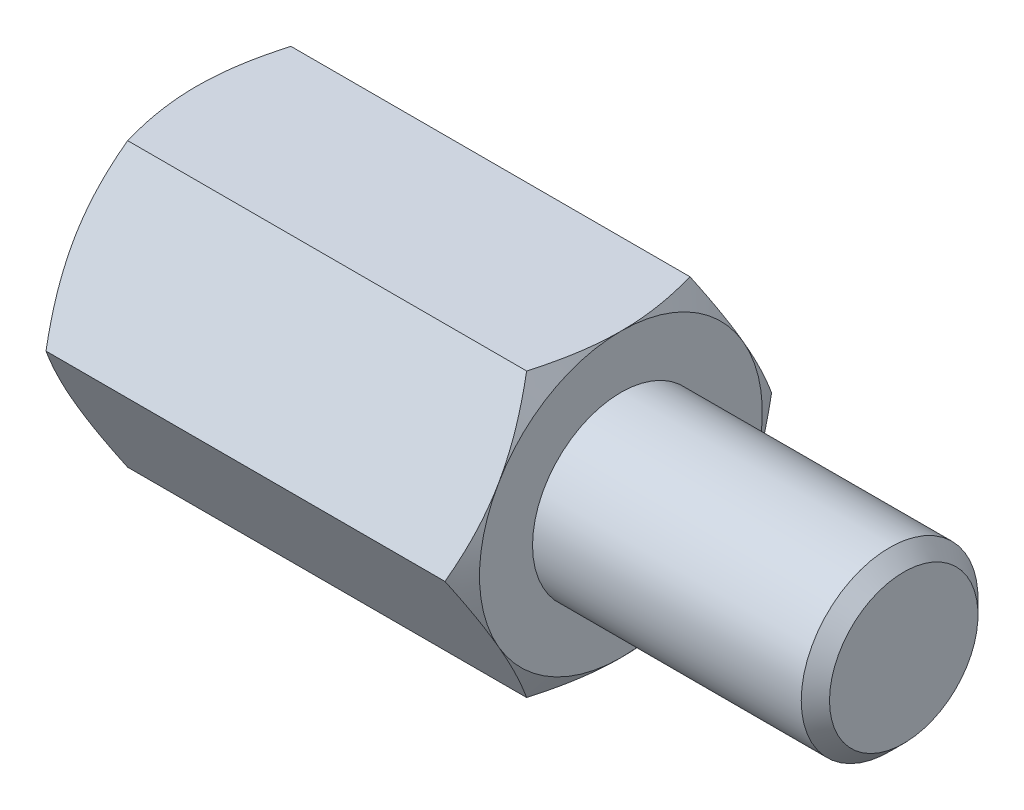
ISO-10303-21;
HEADER;
FILE_DESCRIPTION(('STEP AP214'),'2;1');
FILE_NAME('part.step','',(''),(''),'','','');
FILE_SCHEMA(('AUTOMOTIVE_DESIGN { 1 0 10303 214 1 1 1 1 }'));
ENDSEC;
DATA;
#1=APPLICATION_CONTEXT('core data for automotive mechanical design processes');
#2=APPLICATION_PROTOCOL_DEFINITION('international standard','automotive_design',2000,#1);
#3=PRODUCT_CONTEXT('',#1,'mechanical');
#4=PRODUCT('Part','Part','',(#3));
#5=PRODUCT_RELATED_PRODUCT_CATEGORY('part','',(#4));
#6=PRODUCT_DEFINITION_FORMATION('','',#4);
#7=PRODUCT_DEFINITION_CONTEXT('part definition',#1,'design');
#8=PRODUCT_DEFINITION('design','',#6,#7);
#9=PRODUCT_DEFINITION_SHAPE('','',#8);
#10=(LENGTH_UNIT() NAMED_UNIT(*) SI_UNIT(.MILLI.,.METRE.));
#11=(NAMED_UNIT(*) PLANE_ANGLE_UNIT() SI_UNIT($,.RADIAN.));
#12=(NAMED_UNIT(*) SI_UNIT($,.STERADIAN.) SOLID_ANGLE_UNIT());
#13=UNCERTAINTY_MEASURE_WITH_UNIT(LENGTH_MEASURE(1.E-05),#10,'distance_accuracy_value','');
#14=(GEOMETRIC_REPRESENTATION_CONTEXT(3) GLOBAL_UNCERTAINTY_ASSIGNED_CONTEXT((#13)) GLOBAL_UNIT_ASSIGNED_CONTEXT((#10,
#11,#12)) REPRESENTATION_CONTEXT('',''));
#15=CARTESIAN_POINT('',(0.,0.,0.));
#16=DIRECTION('',(0.,0.,1.));
#17=DIRECTION('',(1.,0.,0.));
#18=AXIS2_PLACEMENT_3D('',#15,#16,#17);
#19=CARTESIAN_POINT('',(6.,4.,-2.3094010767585));
#20=DIRECTION('',(1.,0.,0.));
#21=DIRECTION('',(0.,0.,-1.));
#22=AXIS2_PLACEMENT_3D('',#19,#20,#21);
#23=PLANE('',#22);
#24=CARTESIAN_POINT('',(6.,0.,0.));
#25=DIRECTION('',(1.,0.,0.));
#26=DIRECTION('',(0.,0.,-1.));
#27=AXIS2_PLACEMENT_3D('',#24,#25,#26);
#28=CIRCLE('',#27,4.);
#29=CARTESIAN_POINT('',(6.,-2.,-3.46410161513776));
#30=VERTEX_POINT('',#29);
#31=CARTESIAN_POINT('',(6.,2.,-3.46410161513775));
#32=VERTEX_POINT('',#31);
#33=EDGE_CURVE('E288',#30,#32,#28,.T.);
#34=ORIENTED_EDGE('',*,*,#33,.T.);
#35=CARTESIAN_POINT('',(6.,4.,0.));
#36=VERTEX_POINT('',#35);
#37=EDGE_CURVE('E53',#32,#36,#28,.T.);
#38=ORIENTED_EDGE('',*,*,#37,.T.);
#39=CARTESIAN_POINT('',(6.,2.,3.46410161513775));
#40=VERTEX_POINT('',#39);
#41=EDGE_CURVE('E296',#36,#40,#28,.T.);
#42=ORIENTED_EDGE('',*,*,#41,.T.);
#43=CARTESIAN_POINT('',(6.,-2.,3.46410161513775));
#44=VERTEX_POINT('',#43);
#45=EDGE_CURVE('E301',#40,#44,#28,.T.);
#46=ORIENTED_EDGE('',*,*,#45,.T.);
#47=CARTESIAN_POINT('',(6.,0.,0.));
#48=DIRECTION('',(-1.,0.,0.));
#49=DIRECTION('',(0.,-1.,0.));
#50=AXIS2_PLACEMENT_3D('',#47,#48,#49);
#51=CIRCLE('',#50,4.);
#52=CARTESIAN_POINT('',(6.,-4.,0.));
#53=VERTEX_POINT('',#52);
#54=EDGE_CURVE('E193',#53,#44,#51,.T.);
#55=ORIENTED_EDGE('',*,*,#54,.F.);
#56=EDGE_CURVE('E61',#53,#30,#28,.T.);
#57=ORIENTED_EDGE('',*,*,#56,.T.);
#58=EDGE_LOOP('',(#34,#38,#42,#46,#55,#57));
#59=FACE_BOUND('',#58,.T.);
#60=CARTESIAN_POINT('',(6.,0.,0.));
#61=DIRECTION('',(1.,0.,0.));
#62=DIRECTION('',(0.,0.,-1.));
#63=AXIS2_PLACEMENT_3D('',#60,#61,#62);
#64=CIRCLE('',#63,2.5);
#65=CARTESIAN_POINT('',(6.,0.,-2.5));
#66=VERTEX_POINT('',#65);
#67=EDGE_CURVE('E383',#66,#66,#64,.T.);
#68=ORIENTED_EDGE('',*,*,#67,.F.);
#69=EDGE_LOOP('',(#68));
#70=FACE_BOUND('',#69,.T.);
#71=ADVANCED_FACE('F37',(#59,#70),#23,.T.);
#72=CARTESIAN_POINT('',(6.,0.,-4.61880215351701));
#73=DIRECTION('',(0.,-0.5,0.866025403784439));
#74=DIRECTION('',(0.,-0.866025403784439,-0.5));
#75=AXIS2_PLACEMENT_3D('',#72,#73,#74);
#76=PLANE('',#75);
#77=CARTESIAN_POINT('',(5.64266774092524,-0.000200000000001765,-4.61891762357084));
#78=CARTESIAN_POINT('',(5.70128212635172,0.175579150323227,-4.51743148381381));
#79=CARTESIAN_POINT('',(5.75458967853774,0.352875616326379,-4.41506932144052));
#80=CARTESIAN_POINT('',(5.8476383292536,0.710538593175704,-4.20857250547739));
#81=CARTESIAN_POINT('',(5.8873465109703,0.890911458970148,-4.10443418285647));
#82=CARTESIAN_POINT('',(5.94915778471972,1.24942181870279,-3.89744813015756));
#83=CARTESIAN_POINT('',(5.97167226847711,1.42750415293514,-3.79463224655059));
#84=CARTESIAN_POINT('',(5.99854937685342,1.78450671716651,-3.58851671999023));
#85=CARTESIAN_POINT('',(6.00293425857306,1.9634256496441,-3.48521782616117));
#86=CARTESIAN_POINT('',(5.99380992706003,2.29774284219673,-3.29219970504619));
#87=CARTESIAN_POINT('',(5.98254104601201,2.45319115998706,-3.20245157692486));
#88=CARTESIAN_POINT('',(5.94682600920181,2.76307505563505,-3.02354002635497));
#89=CARTESIAN_POINT('',(5.92236765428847,2.91750956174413,-2.93437722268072));
#90=CARTESIAN_POINT('',(5.86122393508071,3.22803232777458,-2.75509682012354));
#91=CARTESIAN_POINT('',(5.82427939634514,3.3840812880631,-2.6650019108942));
#92=CARTESIAN_POINT('',(5.74042992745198,3.69385183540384,-2.486155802));
#93=CARTESIAN_POINT('',(5.69354469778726,3.84757739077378,-2.39740231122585));
#94=CARTESIAN_POINT('',(5.64266774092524,4.0002,-2.30928560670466));
#95=B_SPLINE_CURVE_WITH_KNOTS('',3,(#77,#78,#79,#80,#81,#82,#83,#84,#85,#86,#87,#88,#89,#90,#91,
#92,#93,#94),.UNSPECIFIED.,.F.,.F.,(4,2,2,2,2,2,2,2,4),(0.,0.634047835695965,1.26961969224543,
1.88946157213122,2.50854226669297,3.04757825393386,3.58711366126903,4.13861653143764,
4.68903648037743),.UNSPECIFIED.);
#96=CARTESIAN_POINT('',(5.64273441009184,0.,-4.61880215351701));
#97=VERTEX_POINT('',#96);
#98=EDGE_CURVE('E318',#97,#32,#95,.T.);
#99=ORIENTED_EDGE('',*,*,#98,.F.);
#100=DIRECTION('',(-1.,0.,0.));
#101=VECTOR('',#100,1.);
#102=CARTESIAN_POINT('',(6.,0.,-4.61880215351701));
#103=LINE('',#102,#101);
#104=CARTESIAN_POINT('',(-5.64273441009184,0.,-4.61880215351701));
#105=VERTEX_POINT('',#104);
#106=EDGE_CURVE('E264',#97,#105,#103,.T.);
#107=ORIENTED_EDGE('',*,*,#106,.T.);
#108=CARTESIAN_POINT('',(-5.64266774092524,4.0002,-2.30928560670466));
#109=CARTESIAN_POINT('',(-5.70128212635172,3.82442084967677,-2.4107717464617));
#110=CARTESIAN_POINT('',(-5.75458967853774,3.64712438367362,-2.51313390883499));
#111=CARTESIAN_POINT('',(-5.8476383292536,3.28946140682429,-2.71963072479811));
#112=CARTESIAN_POINT('',(-5.8873465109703,3.10908854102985,-2.82376904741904));
#113=CARTESIAN_POINT('',(-5.94915778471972,2.75057818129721,-3.03075510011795));
#114=CARTESIAN_POINT('',(-5.97167226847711,2.57249584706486,-3.13357098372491));
#115=CARTESIAN_POINT('',(-5.99854937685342,2.21549328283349,-3.33968651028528));
#116=CARTESIAN_POINT('',(-6.00293425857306,2.0365743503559,-3.44298540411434));
#117=CARTESIAN_POINT('',(-5.99380992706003,1.70225715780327,-3.63600352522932));
#118=CARTESIAN_POINT('',(-5.98254104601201,1.54680884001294,-3.72575165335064));
#119=CARTESIAN_POINT('',(-5.94682600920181,1.23692494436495,-3.90466320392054));
#120=CARTESIAN_POINT('',(-5.92236765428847,1.08249043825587,-3.99382600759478));
#121=CARTESIAN_POINT('',(-5.86122393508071,0.771967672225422,-4.17310641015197));
#122=CARTESIAN_POINT('',(-5.82427939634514,0.615918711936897,-4.26320131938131));
#123=CARTESIAN_POINT('',(-5.74042992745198,0.306148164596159,-4.4420474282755));
#124=CARTESIAN_POINT('',(-5.69354469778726,0.152422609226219,-4.53080091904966));
#125=CARTESIAN_POINT('',(-5.64266774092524,-0.000200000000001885,-4.61891762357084));
#126=B_SPLINE_CURVE_WITH_KNOTS('',3,(#108,#109,#110,#111,#112,#113,#114,#115,#116,#117,#118,
#119,#120,#121,#122,#123,#124,#125),.UNSPECIFIED.,.F.,.F.,(4,2,2,2,2,2,2,2,4),(0.,
0.634047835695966,1.26961969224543,1.88946157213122,2.50854226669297,3.04757825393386,
3.58711366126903,4.13861653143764,4.68903648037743),.UNSPECIFIED.);
#127=CARTESIAN_POINT('',(-6.,2.,-3.46410161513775));
#128=VERTEX_POINT('',#127);
#129=EDGE_CURVE('E320',#128,#105,#126,.T.);
#130=ORIENTED_EDGE('',*,*,#129,.F.);
#131=CARTESIAN_POINT('',(-5.64273441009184,4.,-2.3094010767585));
#132=VERTEX_POINT('',#131);
#133=EDGE_CURVE('E323',#132,#128,#126,.T.);
#134=ORIENTED_EDGE('',*,*,#133,.F.);
#135=DIRECTION('',(-1.,0.,0.));
#136=VECTOR('',#135,1.);
#137=CARTESIAN_POINT('',(6.,4.,-2.3094010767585));
#138=LINE('',#137,#136);
#139=CARTESIAN_POINT('',(5.64273441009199,4.,-2.30940107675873));
#140=VERTEX_POINT('',#139);
#141=EDGE_CURVE('E279',#140,#132,#138,.T.);
#142=ORIENTED_EDGE('',*,*,#141,.F.);
#143=EDGE_CURVE('E229',#32,#140,#95,.T.);
#144=ORIENTED_EDGE('',*,*,#143,.F.);
#145=EDGE_LOOP('',(#99,#107,#130,#134,#142,#144));
#146=FACE_BOUND('',#145,.T.);
#147=ADVANCED_FACE('F148',(#146),#76,.F.);
#148=CARTESIAN_POINT('',(6.,4.,-2.3094010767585));
#149=DIRECTION('',(0.,-1.,0.));
#150=DIRECTION('',(0.,0.,-1.));
#151=AXIS2_PLACEMENT_3D('',#148,#149,#150);
#152=PLANE('',#151);
#153=CARTESIAN_POINT('',(4.00829070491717,4.,-6.28479524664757));
#154=CARTESIAN_POINT('',(4.09370060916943,4.,-6.10939349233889));
#155=CARTESIAN_POINT('',(4.17831482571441,4.,-5.93359774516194));
#156=CARTESIAN_POINT('',(4.34550596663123,4.,-5.58100905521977));
#157=CARTESIAN_POINT('',(4.42808258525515,4.,-5.40421596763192));
#158=CARTESIAN_POINT('',(4.59115082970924,4.,-5.04855089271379));
#159=CARTESIAN_POINT('',(4.67162934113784,4.,-4.86967287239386));
#160=CARTESIAN_POINT('',(4.82940015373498,4.,-4.51052237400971));
#161=CARTESIAN_POINT('',(4.90669260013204,4.,-4.33024995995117));
#162=CARTESIAN_POINT('',(5.05980205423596,4.,-3.96189114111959));
#163=CARTESIAN_POINT('',(5.135480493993,4.,-3.77374683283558));
#164=CARTESIAN_POINT('',(5.28130452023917,4.,-3.39528725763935));
#165=CARTESIAN_POINT('',(5.35144949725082,4.,-3.2049717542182));
#166=CARTESIAN_POINT('',(5.4844245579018,4.,-2.82219775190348));
#167=CARTESIAN_POINT('',(5.5472687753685,4.,-2.62974421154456));
#168=CARTESIAN_POINT('',(5.66367969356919,4.,-2.24207725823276));
#169=CARTESIAN_POINT('',(5.71724923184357,4.,-2.04686470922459));
#170=CARTESIAN_POINT('',(5.81230316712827,4.,-1.65467425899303));
#171=CARTESIAN_POINT('',(5.85385633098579,4.,-1.45771333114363));
#172=CARTESIAN_POINT('',(5.92259036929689,4.,-1.06125849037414));
#173=CARTESIAN_POINT('',(5.94977273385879,4.,-0.861764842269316));
#174=CARTESIAN_POINT('',(5.98724473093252,4.,-0.463879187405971));
#175=CARTESIAN_POINT('',(5.99775780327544,4.,-0.265508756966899));
#176=CARTESIAN_POINT('',(6.00159342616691,4.,0.131417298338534));
#177=CARTESIAN_POINT('',(5.99491584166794,4.,0.329972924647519));
#178=CARTESIAN_POINT('',(5.96964892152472,4.,0.664692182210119));
#179=CARTESIAN_POINT('',(5.95537089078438,4.,0.801202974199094));
#180=CARTESIAN_POINT('',(5.9195349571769,4.,1.07327201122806));
#181=CARTESIAN_POINT('',(5.89797613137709,4.,1.20883013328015));
#182=CARTESIAN_POINT('',(5.82350663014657,4.,1.61386939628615));
#183=CARTESIAN_POINT('',(5.76081499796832,4.,1.8815748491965));
#184=CARTESIAN_POINT('',(5.65151174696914,4.,2.28197262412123));
#185=CARTESIAN_POINT('',(5.61200931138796,4.,2.41672443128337));
#186=CARTESIAN_POINT('',(5.52875235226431,4.,2.68492067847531));
#187=CARTESIAN_POINT('',(5.48499779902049,4.,2.81836510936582));
#188=CARTESIAN_POINT('',(5.39395104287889,4.,3.0839859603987));
#189=CARTESIAN_POINT('',(5.34665989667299,4.,3.21616274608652));
#190=CARTESIAN_POINT('',(5.24911111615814,4.,3.47941134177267));
#191=CARTESIAN_POINT('',(5.1988535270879,4.,3.61048316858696));
#192=CARTESIAN_POINT('',(5.07132952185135,4.,3.93385125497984));
#193=CARTESIAN_POINT('',(4.9926014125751,4.,4.1255702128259));
#194=CARTESIAN_POINT('',(4.83096938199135,4.,4.5072455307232));
#195=CARTESIAN_POINT('',(4.74806513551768,4.,4.69720175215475));
#196=CARTESIAN_POINT('',(4.5789699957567,4.,5.0756995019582));
#197=CARTESIAN_POINT('',(4.49277827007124,4.,5.264240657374));
#198=CARTESIAN_POINT('',(4.3178011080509,4.,5.64011758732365));
#199=CARTESIAN_POINT('',(4.22901560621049,4.,5.82745333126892));
#200=CARTESIAN_POINT('',(3.95934323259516,4.,6.3884442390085));
#201=CARTESIAN_POINT('',(3.77535618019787,4.,6.76060781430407));
#202=CARTESIAN_POINT('',(3.4019562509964,4.,7.50211228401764));
#203=CARTESIAN_POINT('',(3.21254420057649,4.,7.87145359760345));
#204=CARTESIAN_POINT('',(2.84738774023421,4.,8.57450173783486));
#205=CARTESIAN_POINT('',(2.67197556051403,4.,8.90838144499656));
#206=CARTESIAN_POINT('',(2.31880976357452,4.,9.57491712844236));
#207=CARTESIAN_POINT('',(2.14105604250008,4.,9.9075730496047));
#208=CARTESIAN_POINT('',(1.78429339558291,4.,10.5709822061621));
#209=CARTESIAN_POINT('',(1.60528952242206,3.99999999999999,10.9017381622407));
#210=CARTESIAN_POINT('',(1.24590712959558,3.99999999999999,11.5624752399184));
#211=CARTESIAN_POINT('',(1.06552869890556,3.99999999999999,11.8924564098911));
#212=CARTESIAN_POINT('',(0.884642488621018,3.99999999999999,12.2221569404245));
#213=B_SPLINE_CURVE_WITH_KNOTS('',3,(#153,#154,#155,#156,#157,#158,#159,#160,#161,#162,#163,
#164,#165,#166,#167,#168,#169,#170,#171,#172,#173,#174,#175,#176,#177,#178,#179,#180,#181,#182,
#183,#184,#185,#186,#187,#188,#189,#190,#191,#192,#193,#194,#195,#196,#197,#198,#199,#200,#201,
#202,#203,#204,#205,#206,#207,#208,#209,#210,#211,#212),.UNSPECIFIED.,.F.,.F.,(4,2,2,2,2,2,2,2,
2,2,2,2,2,2,2,2,2,2,2,2,2,2,2,2,2,2,2,2,2,4),(0.,0.585280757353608,1.17064881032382,
1.75906864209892,2.34746162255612,2.95577704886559,3.56415938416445,4.17134357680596,
4.7783416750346,5.38179402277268,5.98518378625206,6.58041501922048,7.17565092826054,
7.5872191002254,7.99883946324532,8.82250155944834,9.24373134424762,9.66496407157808,
10.086071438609,10.5071723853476,11.1288656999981,11.7506074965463,12.3725077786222,
12.9944237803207,14.2398211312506,15.4850297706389,16.6164791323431,17.7479788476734,
18.8762380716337,20.0044248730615),.UNSPECIFIED.);
#214=EDGE_CURVE('E227',#140,#36,#213,.T.);
#215=ORIENTED_EDGE('',*,*,#214,.F.);
#216=ORIENTED_EDGE('',*,*,#141,.T.);
#217=CARTESIAN_POINT('',(-4.00829070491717,4.,-6.28479524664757));
#218=CARTESIAN_POINT('',(-4.09370060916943,4.,-6.10939349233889));
#219=CARTESIAN_POINT('',(-4.17831482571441,4.,-5.93359774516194));
#220=CARTESIAN_POINT('',(-4.34550596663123,4.,-5.58100905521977));
#221=CARTESIAN_POINT('',(-4.42808258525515,4.,-5.40421596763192));
#222=CARTESIAN_POINT('',(-4.59115082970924,4.,-5.04855089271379));
#223=CARTESIAN_POINT('',(-4.67162934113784,4.,-4.86967287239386));
#224=CARTESIAN_POINT('',(-4.82940015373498,4.,-4.51052237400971));
#225=CARTESIAN_POINT('',(-4.90669260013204,4.,-4.33024995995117));
#226=CARTESIAN_POINT('',(-5.05980205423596,4.,-3.96189114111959));
#227=CARTESIAN_POINT('',(-5.135480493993,4.,-3.77374683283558));
#228=CARTESIAN_POINT('',(-5.28130452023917,4.,-3.39528725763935));
#229=CARTESIAN_POINT('',(-5.35144949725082,4.,-3.2049717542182));
#230=CARTESIAN_POINT('',(-5.4844245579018,4.,-2.82219775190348));
#231=CARTESIAN_POINT('',(-5.5472687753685,4.,-2.62974421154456));
#232=CARTESIAN_POINT('',(-5.66367969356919,4.,-2.24207725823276));
#233=CARTESIAN_POINT('',(-5.71724923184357,4.,-2.04686470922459));
#234=CARTESIAN_POINT('',(-5.81230316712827,4.,-1.65467425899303));
#235=CARTESIAN_POINT('',(-5.85385633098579,4.,-1.45771333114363));
#236=CARTESIAN_POINT('',(-5.92259036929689,4.,-1.06125849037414));
#237=CARTESIAN_POINT('',(-5.94977273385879,4.,-0.861764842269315));
#238=CARTESIAN_POINT('',(-5.98724473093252,4.,-0.463879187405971));
#239=CARTESIAN_POINT('',(-5.99775780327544,4.,-0.265508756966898));
#240=CARTESIAN_POINT('',(-6.00159342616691,4.,0.131417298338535));
#241=CARTESIAN_POINT('',(-5.99491584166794,4.,0.32997292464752));
#242=CARTESIAN_POINT('',(-5.96964892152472,4.,0.664692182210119));
#243=CARTESIAN_POINT('',(-5.95537089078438,4.,0.801202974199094));
#244=CARTESIAN_POINT('',(-5.9195349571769,4.,1.07327201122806));
#245=CARTESIAN_POINT('',(-5.89797613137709,4.,1.20883013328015));
#246=CARTESIAN_POINT('',(-5.82350663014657,4.,1.61386939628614));
#247=CARTESIAN_POINT('',(-5.76081499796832,4.,1.8815748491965));
#248=CARTESIAN_POINT('',(-5.65151174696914,4.,2.28197262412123));
#249=CARTESIAN_POINT('',(-5.61200931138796,4.,2.41672443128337));
#250=CARTESIAN_POINT('',(-5.52875235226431,4.,2.68492067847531));
#251=CARTESIAN_POINT('',(-5.48499779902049,4.,2.81836510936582));
#252=CARTESIAN_POINT('',(-5.39395104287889,4.,3.0839859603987));
#253=CARTESIAN_POINT('',(-5.34665989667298,4.,3.21616274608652));
#254=CARTESIAN_POINT('',(-5.24911111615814,4.,3.47941134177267));
#255=CARTESIAN_POINT('',(-5.1988535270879,4.,3.61048316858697));
#256=CARTESIAN_POINT('',(-5.07132952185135,4.,3.93385125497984));
#257=CARTESIAN_POINT('',(-4.9926014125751,4.,4.1255702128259));
#258=CARTESIAN_POINT('',(-4.83096938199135,4.,4.5072455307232));
#259=CARTESIAN_POINT('',(-4.74806513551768,4.,4.69720175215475));
#260=CARTESIAN_POINT('',(-4.5789699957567,4.,5.0756995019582));
#261=CARTESIAN_POINT('',(-4.49277827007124,4.,5.264240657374));
#262=CARTESIAN_POINT('',(-4.3178011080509,4.,5.64011758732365));
#263=CARTESIAN_POINT('',(-4.22901560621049,4.,5.82745333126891));
#264=CARTESIAN_POINT('',(-3.95934323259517,4.,6.3884442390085));
#265=CARTESIAN_POINT('',(-3.77535618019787,4.,6.76060781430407));
#266=CARTESIAN_POINT('',(-3.4019562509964,4.,7.50211228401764));
#267=CARTESIAN_POINT('',(-3.2125442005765,4.,7.87145359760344));
#268=CARTESIAN_POINT('',(-2.84738774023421,4.,8.57450173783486));
#269=CARTESIAN_POINT('',(-2.67197556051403,4.,8.90838144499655));
#270=CARTESIAN_POINT('',(-2.31880976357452,4.,9.57491712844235));
#271=CARTESIAN_POINT('',(-2.14105604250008,4.,9.9075730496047));
#272=CARTESIAN_POINT('',(-1.78429339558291,4.,10.5709822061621));
#273=CARTESIAN_POINT('',(-1.60528952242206,3.99999999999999,10.9017381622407));
#274=CARTESIAN_POINT('',(-1.24590712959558,3.99999999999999,11.5624752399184));
#275=CARTESIAN_POINT('',(-1.06552869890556,3.99999999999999,11.8924564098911));
#276=CARTESIAN_POINT('',(-0.884642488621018,3.99999999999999,12.2221569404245));
#277=B_SPLINE_CURVE_WITH_KNOTS('',3,(#217,#218,#219,#220,#221,#222,#223,#224,#225,#226,#227,
#228,#229,#230,#231,#232,#233,#234,#235,#236,#237,#238,#239,#240,#241,#242,#243,#244,#245,#246,
#247,#248,#249,#250,#251,#252,#253,#254,#255,#256,#257,#258,#259,#260,#261,#262,#263,#264,#265,
#266,#267,#268,#269,#270,#271,#272,#273,#274,#275,#276),.UNSPECIFIED.,.F.,.F.,(4,2,2,2,2,2,2,2,
2,2,2,2,2,2,2,2,2,2,2,2,2,2,2,2,2,2,2,2,2,4),(0.,0.585280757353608,1.17064881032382,
1.75906864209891,2.34746162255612,2.95577704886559,3.56415938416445,4.17134357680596,
4.7783416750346,5.38179402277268,5.98518378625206,6.58041501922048,7.17565092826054,
7.58721910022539,7.99883946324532,8.82250155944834,9.24373134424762,9.66496407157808,
10.086071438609,10.5071723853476,11.1288656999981,11.7506074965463,12.3725077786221,
12.9944237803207,14.2398211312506,15.4850297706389,16.6164791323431,17.7479788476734,
18.8762380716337,20.0044248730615),.UNSPECIFIED.);
#278=CARTESIAN_POINT('',(-6.,4.,0.));
#279=VERTEX_POINT('',#278);
#280=EDGE_CURVE('E241',#279,#132,#277,.F.);
#281=ORIENTED_EDGE('',*,*,#280,.F.);
#282=CARTESIAN_POINT('',(-5.64273441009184,4.,2.3094010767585));
#283=VERTEX_POINT('',#282);
#284=EDGE_CURVE('E249',#283,#279,#277,.F.);
#285=ORIENTED_EDGE('',*,*,#284,.F.);
#286=DIRECTION('',(-1.,0.,0.));
#287=VECTOR('',#286,1.);
#288=CARTESIAN_POINT('',(6.,4.,2.3094010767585));
#289=LINE('',#288,#287);
#290=CARTESIAN_POINT('',(5.64273441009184,4.,2.3094010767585));
#291=VERTEX_POINT('',#290);
#292=EDGE_CURVE('E276',#291,#283,#289,.T.);
#293=ORIENTED_EDGE('',*,*,#292,.F.);
#294=EDGE_CURVE('E221',#36,#291,#213,.T.);
#295=ORIENTED_EDGE('',*,*,#294,.F.);
#296=EDGE_LOOP('',(#215,#216,#281,#285,#293,#295));
#297=FACE_BOUND('',#296,.T.);
#298=ADVANCED_FACE('F153',(#297),#152,.F.);
#299=CARTESIAN_POINT('',(6.,4.,2.3094010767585));
#300=DIRECTION('',(0.,-0.5,-0.866025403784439));
#301=DIRECTION('',(0.,0.866025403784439,-0.5));
#302=AXIS2_PLACEMENT_3D('',#299,#300,#301);
#303=PLANE('',#302);
#304=CARTESIAN_POINT('',(5.64266774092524,4.0002,2.30928560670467));
#305=CARTESIAN_POINT('',(5.70128212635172,3.82442084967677,2.4107717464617));
#306=CARTESIAN_POINT('',(5.75458967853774,3.64712438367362,2.51313390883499));
#307=CARTESIAN_POINT('',(5.8476383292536,3.28946140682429,2.71963072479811));
#308=CARTESIAN_POINT('',(5.8873465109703,3.10908854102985,2.82376904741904));
#309=CARTESIAN_POINT('',(5.94915778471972,2.75057818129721,3.03075510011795));
#310=CARTESIAN_POINT('',(5.97167226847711,2.57249584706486,3.13357098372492));
#311=CARTESIAN_POINT('',(5.99854937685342,2.21549328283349,3.33968651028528));
#312=CARTESIAN_POINT('',(6.00293425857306,2.0365743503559,3.44298540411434));
#313=CARTESIAN_POINT('',(5.99380992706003,1.70225715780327,3.63600352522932));
#314=CARTESIAN_POINT('',(5.98254104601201,1.54680884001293,3.72575165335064));
#315=CARTESIAN_POINT('',(5.94682600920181,1.23692494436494,3.90466320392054));
#316=CARTESIAN_POINT('',(5.92236765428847,1.08249043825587,3.99382600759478));
#317=CARTESIAN_POINT('',(5.86122393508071,0.771967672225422,4.17310641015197));
#318=CARTESIAN_POINT('',(5.82427939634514,0.615918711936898,4.26320131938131));
#319=CARTESIAN_POINT('',(5.74042992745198,0.306148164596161,4.4420474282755));
#320=CARTESIAN_POINT('',(5.69354469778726,0.152422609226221,4.53080091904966));
#321=CARTESIAN_POINT('',(5.64266774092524,-0.000199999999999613,4.61891762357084));
#322=B_SPLINE_CURVE_WITH_KNOTS('',3,(#304,#305,#306,#307,#308,#309,#310,#311,#312,#313,#314,
#315,#316,#317,#318,#319,#320,#321),.UNSPECIFIED.,.F.,.F.,(4,2,2,2,2,2,2,2,4),(0.,
0.634047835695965,1.26961969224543,1.88946157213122,2.50854226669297,3.04757825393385,
3.58711366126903,4.13861653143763,4.68903648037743),.UNSPECIFIED.);
#323=EDGE_CURVE('E228',#291,#40,#322,.T.);
#324=ORIENTED_EDGE('',*,*,#323,.F.);
#325=ORIENTED_EDGE('',*,*,#292,.T.);
#326=CARTESIAN_POINT('',(-5.64266774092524,-0.000199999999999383,4.61891762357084));
#327=CARTESIAN_POINT('',(-5.70128212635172,0.175579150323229,4.5174314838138));
#328=CARTESIAN_POINT('',(-5.75458967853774,0.352875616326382,4.41506932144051));
#329=CARTESIAN_POINT('',(-5.8476383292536,0.710538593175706,4.20857250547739));
#330=CARTESIAN_POINT('',(-5.8873465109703,0.89091145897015,4.10443418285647));
#331=CARTESIAN_POINT('',(-5.94915778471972,1.24942181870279,3.89744813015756));
#332=CARTESIAN_POINT('',(-5.97167226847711,1.42750415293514,3.79463224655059));
#333=CARTESIAN_POINT('',(-5.99854937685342,1.78450671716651,3.58851671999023));
#334=CARTESIAN_POINT('',(-6.00293425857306,1.9634256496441,3.48521782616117));
#335=CARTESIAN_POINT('',(-5.99380992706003,2.29774284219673,3.29219970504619));
#336=CARTESIAN_POINT('',(-5.98254104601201,2.45319115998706,3.20245157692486));
#337=CARTESIAN_POINT('',(-5.94682600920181,2.76307505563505,3.02354002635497));
#338=CARTESIAN_POINT('',(-5.92236765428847,2.91750956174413,2.93437722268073));
#339=CARTESIAN_POINT('',(-5.86122393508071,3.22803232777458,2.75509682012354));
#340=CARTESIAN_POINT('',(-5.82427939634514,3.3840812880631,2.6650019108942));
#341=CARTESIAN_POINT('',(-5.74042992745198,3.69385183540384,2.48615580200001));
#342=CARTESIAN_POINT('',(-5.69354469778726,3.84757739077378,2.39740231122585));
#343=CARTESIAN_POINT('',(-5.64266774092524,4.0002,2.30928560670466));
#344=B_SPLINE_CURVE_WITH_KNOTS('',3,(#326,#327,#328,#329,#330,#331,#332,#333,#334,#335,#336,
#337,#338,#339,#340,#341,#342,#343),.UNSPECIFIED.,.F.,.F.,(4,2,2,2,2,2,2,2,4),(0.,
0.634047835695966,1.26961969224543,1.88946157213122,2.50854226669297,3.04757825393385,
3.58711366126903,4.13861653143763,4.68903648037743),.UNSPECIFIED.);
#345=CARTESIAN_POINT('',(-6.,2.,3.46410161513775));
#346=VERTEX_POINT('',#345);
#347=EDGE_CURVE('E255',#346,#283,#344,.T.);
#348=ORIENTED_EDGE('',*,*,#347,.F.);
#349=CARTESIAN_POINT('',(-5.64273441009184,0.,4.618802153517));
#350=VERTEX_POINT('',#349);
#351=EDGE_CURVE('E262',#350,#346,#344,.T.);
#352=ORIENTED_EDGE('',*,*,#351,.F.);
#353=DIRECTION('',(-1.,0.,0.));
#354=VECTOR('',#353,1.);
#355=CARTESIAN_POINT('',(6.,0.,4.618802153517));
#356=LINE('',#355,#354);
#357=CARTESIAN_POINT('',(5.64273441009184,0.,4.618802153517));
#358=VERTEX_POINT('',#357);
#359=EDGE_CURVE('E273',#358,#350,#356,.T.);
#360=ORIENTED_EDGE('',*,*,#359,.F.);
#361=EDGE_CURVE('E215',#40,#358,#322,.T.);
#362=ORIENTED_EDGE('',*,*,#361,.F.);
#363=EDGE_LOOP('',(#324,#325,#348,#352,#360,#362));
#364=FACE_BOUND('',#363,.T.);
#365=ADVANCED_FACE('F235',(#364),#303,.F.);
#366=CARTESIAN_POINT('',(6.,0.,4.618802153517));
#367=DIRECTION('',(0.,0.5,-0.866025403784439));
#368=DIRECTION('',(0.,0.866025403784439,0.5));
#369=AXIS2_PLACEMENT_3D('',#366,#367,#368);
#370=PLANE('',#369);
#371=CARTESIAN_POINT('',(5.64266774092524,0.000200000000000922,4.61891762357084));
#372=CARTESIAN_POINT('',(5.70128212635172,-0.175579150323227,4.5174314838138));
#373=CARTESIAN_POINT('',(5.75458967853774,-0.352875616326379,4.41506932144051));
#374=CARTESIAN_POINT('',(5.8476383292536,-0.710538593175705,4.20857250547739));
#375=CARTESIAN_POINT('',(5.8873465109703,-0.890911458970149,4.10443418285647));
#376=CARTESIAN_POINT('',(5.94915778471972,-1.24942181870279,3.89744813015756));
#377=CARTESIAN_POINT('',(5.97167226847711,-1.42750415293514,3.79463224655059));
#378=CARTESIAN_POINT('',(5.99854937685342,-1.78450671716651,3.58851671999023));
#379=CARTESIAN_POINT('',(6.00293425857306,-1.9634256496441,3.48521782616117));
#380=CARTESIAN_POINT('',(5.99380992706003,-2.29774284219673,3.29219970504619));
#381=CARTESIAN_POINT('',(5.98254104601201,-2.45319115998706,3.20245157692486));
#382=CARTESIAN_POINT('',(5.94682600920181,-2.76307505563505,3.02354002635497));
#383=CARTESIAN_POINT('',(5.92236765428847,-2.91750956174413,2.93437722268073));
#384=CARTESIAN_POINT('',(5.86122393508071,-3.22803232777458,2.75509682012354));
#385=CARTESIAN_POINT('',(5.82427939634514,-3.3840812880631,2.6650019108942));
#386=CARTESIAN_POINT('',(5.74042992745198,-3.69385183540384,2.48615580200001));
#387=CARTESIAN_POINT('',(5.69354469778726,-3.84757739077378,2.39740231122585));
#388=CARTESIAN_POINT('',(5.64266774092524,-4.0002,2.30928560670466));
#389=B_SPLINE_CURVE_WITH_KNOTS('',3,(#371,#372,#373,#374,#375,#376,#377,#378,#379,#380,#381,
#382,#383,#384,#385,#386,#387,#388),.UNSPECIFIED.,.F.,.F.,(4,2,2,2,2,2,2,2,4),(0.,
0.634047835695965,1.26961969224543,1.88946157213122,2.50854226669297,3.04757825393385,
3.58711366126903,4.13861653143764,4.68903648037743),.UNSPECIFIED.);
#390=EDGE_CURVE('E315',#358,#44,#389,.T.);
#391=ORIENTED_EDGE('',*,*,#390,.F.);
#392=ORIENTED_EDGE('',*,*,#359,.T.);
#393=CARTESIAN_POINT('',(-5.64266774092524,-4.0002,2.30928560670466));
#394=CARTESIAN_POINT('',(-5.70128212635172,-3.82442084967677,2.4107717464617));
#395=CARTESIAN_POINT('',(-5.75458967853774,-3.64712438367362,2.51313390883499));
#396=CARTESIAN_POINT('',(-5.8476383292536,-3.28946140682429,2.71963072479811));
#397=CARTESIAN_POINT('',(-5.8873465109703,-3.10908854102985,2.82376904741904));
#398=CARTESIAN_POINT('',(-5.94915778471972,-2.75057818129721,3.03075510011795));
#399=CARTESIAN_POINT('',(-5.97167226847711,-2.57249584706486,3.13357098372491));
#400=CARTESIAN_POINT('',(-5.99854937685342,-2.21549328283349,3.33968651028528));
#401=CARTESIAN_POINT('',(-6.00293425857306,-2.0365743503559,3.44298540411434));
#402=CARTESIAN_POINT('',(-5.99380992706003,-1.70225715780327,3.63600352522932));
#403=CARTESIAN_POINT('',(-5.98254104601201,-1.54680884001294,3.72575165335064));
#404=CARTESIAN_POINT('',(-5.94682600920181,-1.23692494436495,3.90466320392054));
#405=CARTESIAN_POINT('',(-5.92236765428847,-1.08249043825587,3.99382600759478));
#406=CARTESIAN_POINT('',(-5.86122393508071,-0.771967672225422,4.17310641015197));
#407=CARTESIAN_POINT('',(-5.82427939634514,-0.615918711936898,4.26320131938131));
#408=CARTESIAN_POINT('',(-5.74042992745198,-0.30614816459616,4.4420474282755));
#409=CARTESIAN_POINT('',(-5.69354469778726,-0.15242260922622,4.53080091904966));
#410=CARTESIAN_POINT('',(-5.64266774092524,0.000200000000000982,4.61891762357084));
#411=B_SPLINE_CURVE_WITH_KNOTS('',3,(#393,#394,#395,#396,#397,#398,#399,#400,#401,#402,#403,
#404,#405,#406,#407,#408,#409,#410),.UNSPECIFIED.,.F.,.F.,(4,2,2,2,2,2,2,2,4),(0.,
0.634047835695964,1.26961969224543,1.88946157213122,2.50854226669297,3.04757825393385,
3.58711366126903,4.13861653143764,4.68903648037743),.UNSPECIFIED.);
#412=CARTESIAN_POINT('',(-6.,-2.,3.46410161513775));
#413=VERTEX_POINT('',#412);
#414=EDGE_CURVE('E263',#413,#350,#411,.T.);
#415=ORIENTED_EDGE('',*,*,#414,.F.);
#416=CARTESIAN_POINT('',(-5.64273441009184,-4.,2.3094010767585));
#417=VERTEX_POINT('',#416);
#418=EDGE_CURVE('E250',#417,#413,#411,.T.);
#419=ORIENTED_EDGE('',*,*,#418,.F.);
#420=DIRECTION('',(-1.,0.,0.));
#421=VECTOR('',#420,1.);
#422=CARTESIAN_POINT('',(6.,-4.,2.3094010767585));
#423=LINE('',#422,#421);
#424=CARTESIAN_POINT('',(5.64273441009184,-4.,2.3094010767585));
#425=VERTEX_POINT('',#424);
#426=EDGE_CURVE('E270',#425,#417,#423,.T.);
#427=ORIENTED_EDGE('',*,*,#426,.F.);
#428=EDGE_CURVE('E210',#44,#425,#389,.T.);
#429=ORIENTED_EDGE('',*,*,#428,.F.);
#430=EDGE_LOOP('',(#391,#392,#415,#419,#427,#429));
#431=FACE_BOUND('',#430,.T.);
#432=ADVANCED_FACE('F407',(#431),#370,.F.);
#433=CARTESIAN_POINT('',(6.,-4.,2.3094010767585));
#434=DIRECTION('',(0.,1.,0.));
#435=DIRECTION('',(0.,0.,1.));
#436=AXIS2_PLACEMENT_3D('',#433,#434,#435);
#437=PLANE('',#436);
#438=CARTESIAN_POINT('',(4.00829070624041,-4.,-6.28479524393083));
#439=CARTESIAN_POINT('',(4.09370061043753,-4.,-6.10939348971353));
#440=CARTESIAN_POINT('',(4.1783148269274,-4.,-5.93359774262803));
#441=CARTESIAN_POINT('',(4.34550596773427,-4.,-5.58100905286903));
#442=CARTESIAN_POINT('',(4.42808258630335,-4.,-5.40421596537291));
#443=CARTESIAN_POINT('',(4.59115083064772,-4.,-5.04855089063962));
#444=CARTESIAN_POINT('',(4.67162934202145,-4.,-4.86967287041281));
#445=CARTESIAN_POINT('',(4.82940015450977,-4.,-4.51052237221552));
#446=CARTESIAN_POINT('',(4.90669260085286,-4.,-4.33024995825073));
#447=CARTESIAN_POINT('',(5.05980205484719,-4.,-3.96189113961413));
#448=CARTESIAN_POINT('',(5.13548049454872,-4.,-3.77374683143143));
#449=CARTESIAN_POINT('',(5.28130452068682,-4.,-3.39528725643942));
#450=CARTESIAN_POINT('',(5.35144949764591,-4.,-3.2049717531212));
#451=CARTESIAN_POINT('',(5.48442455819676,-4.,-2.82219775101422));
#452=CARTESIAN_POINT('',(5.54726877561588,-4.,-2.62974421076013));
#453=CARTESIAN_POINT('',(5.66367969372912,-4.,-2.24207725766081));
#454=CARTESIAN_POINT('',(5.71724923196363,-4.,-2.04686470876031));
#455=CARTESIAN_POINT('',(5.81230316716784,-4.,-1.65467425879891));
#456=CARTESIAN_POINT('',(5.85385633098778,-4.,-1.45771333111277));
#457=CARTESIAN_POINT('',(5.9225903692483,-4.,-1.06125849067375));
#458=CARTESIAN_POINT('',(5.94977273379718,-4.,-0.861764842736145));
#459=CARTESIAN_POINT('',(5.9872447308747,-4.,-0.463879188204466));
#460=CARTESIAN_POINT('',(5.99775780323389,-4.,-0.265508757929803));
#461=CARTESIAN_POINT('',(6.00159342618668,-4.,0.131417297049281));
#462=CARTESIAN_POINT('',(5.99491584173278,-4.,0.329972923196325));
#463=CARTESIAN_POINT('',(5.96964892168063,-4.,0.664692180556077));
#464=CARTESIAN_POINT('',(5.95537089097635,-4.,0.80120297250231));
#465=CARTESIAN_POINT('',(5.9195349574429,-4.,1.07327200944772));
#466=CARTESIAN_POINT('',(5.89797613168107,-4.,1.208830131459));
#467=CARTESIAN_POINT('',(5.82350663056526,-4.,1.6138693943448));
#468=CARTESIAN_POINT('',(5.76081499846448,-4.,1.88157484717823));
#469=CARTESIAN_POINT('',(5.65151174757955,-4.,2.28197262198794));
#470=CARTESIAN_POINT('',(5.6120093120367,-4.,2.41672442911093));
#471=CARTESIAN_POINT('',(5.52875235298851,-4.,2.68492067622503));
#472=CARTESIAN_POINT('',(5.48499779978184,-4.,2.81836510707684));
#473=CARTESIAN_POINT('',(5.39395104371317,-4.,3.0839859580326));
#474=CARTESIAN_POINT('',(5.34665989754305,-4.,3.21616274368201));
#475=CARTESIAN_POINT('',(5.24911111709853,-4.,3.47941133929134));
#476=CARTESIAN_POINT('',(5.19885352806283,-4.,3.61048316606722));
#477=CARTESIAN_POINT('',(5.07132952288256,-4.,3.93385125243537));
#478=CARTESIAN_POINT('',(4.99260141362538,-4.,4.12557021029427));
#479=CARTESIAN_POINT('',(4.83096938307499,-4.,4.50724552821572));
#480=CARTESIAN_POINT('',(4.7480651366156,-4.,4.69720174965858));
#481=CARTESIAN_POINT('',(4.57896999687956,-4.,5.07569949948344));
#482=CARTESIAN_POINT('',(4.49277827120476,-4.,5.26424065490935));
#483=CARTESIAN_POINT('',(4.31780110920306,-4.,5.64011758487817));
#484=CARTESIAN_POINT('',(4.22901560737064,-4.,5.8274533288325));
#485=CARTESIAN_POINT('',(3.95934323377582,-4.,6.38844423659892));
#486=CARTESIAN_POINT('',(3.77535618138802,-4.,6.76060781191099));
#487=CARTESIAN_POINT('',(3.40195625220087,-4.,7.50211228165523));
#488=CARTESIAN_POINT('',(3.2125442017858,-4.,7.8714535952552));
#489=CARTESIAN_POINT('',(2.84738774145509,-4.,8.57450173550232));
#490=CARTESIAN_POINT('',(2.671975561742,-4.,8.90838144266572));
#491=CARTESIAN_POINT('',(2.3188097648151,-4.,9.57491712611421));
#492=CARTESIAN_POINT('',(2.1410560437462,-4.,9.90757304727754));
#493=CARTESIAN_POINT('',(1.78429339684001,-4.,10.5709822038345));
#494=CARTESIAN_POINT('',(1.60528952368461,-4.,10.9017381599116));
#495=CARTESIAN_POINT('',(1.24590713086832,-4.,11.562475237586));
#496=CARTESIAN_POINT('',(1.06552870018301,-4.,11.8924564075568));
#497=CARTESIAN_POINT('',(0.884642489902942,-4.,12.2221569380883));
#498=B_SPLINE_CURVE_WITH_KNOTS('',3,(#438,#439,#440,#441,#442,#443,#444,#445,#446,#447,#448,
#449,#450,#451,#452,#453,#454,#455,#456,#457,#458,#459,#460,#461,#462,#463,#464,#465,#466,#467,
#468,#469,#470,#471,#472,#473,#474,#475,#476,#477,#478,#479,#480,#481,#482,#483,#484,#485,#486,
#487,#488,#489,#490,#491,#492,#493,#494,#495,#496,#497),.UNSPECIFIED.,.F.,.F.,(4,2,2,2,2,2,2,2,
2,2,2,2,2,2,2,2,2,2,2,2,2,2,2,2,2,2,2,2,2,4),(0.,0.585280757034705,1.17064880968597,
1.75906864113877,2.34746162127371,2.95577704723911,3.56415938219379,4.17134357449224,
4.7783416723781,5.38179401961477,5.98518378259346,6.58041501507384,7.1756509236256,
7.5872190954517,7.99883945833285,8.82250155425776,9.24373133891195,9.66496406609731,
10.0860714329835,10.5071723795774,11.1288656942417,11.7506074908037,12.3725077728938,
12.9944237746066,14.2398211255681,15.4850297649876,16.6164791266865,17.7479788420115,
18.8762380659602,20.0044248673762),.UNSPECIFIED.);
#499=EDGE_CURVE('E387',#425,#53,#498,.F.);
#500=ORIENTED_EDGE('',*,*,#499,.F.);
#501=ORIENTED_EDGE('',*,*,#426,.T.);
#502=CARTESIAN_POINT('',(-4.00829070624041,-4.,-6.28479524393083));
#503=CARTESIAN_POINT('',(-4.09370061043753,-4.,-6.10939348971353));
#504=CARTESIAN_POINT('',(-4.1783148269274,-4.,-5.93359774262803));
#505=CARTESIAN_POINT('',(-4.34550596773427,-4.,-5.58100905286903));
#506=CARTESIAN_POINT('',(-4.42808258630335,-4.,-5.40421596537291));
#507=CARTESIAN_POINT('',(-4.59115083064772,-4.,-5.04855089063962));
#508=CARTESIAN_POINT('',(-4.67162934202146,-4.,-4.86967287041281));
#509=CARTESIAN_POINT('',(-4.82940015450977,-4.,-4.51052237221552));
#510=CARTESIAN_POINT('',(-4.90669260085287,-4.,-4.33024995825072));
#511=CARTESIAN_POINT('',(-5.05980205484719,-4.,-3.96189113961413));
#512=CARTESIAN_POINT('',(-5.13548049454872,-4.,-3.77374683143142));
#513=CARTESIAN_POINT('',(-5.28130452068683,-4.,-3.39528725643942));
#514=CARTESIAN_POINT('',(-5.35144949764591,-4.,-3.20497175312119));
#515=CARTESIAN_POINT('',(-5.48442455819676,-4.,-2.82219775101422));
#516=CARTESIAN_POINT('',(-5.54726877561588,-4.,-2.62974421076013));
#517=CARTESIAN_POINT('',(-5.66367969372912,-4.,-2.24207725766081));
#518=CARTESIAN_POINT('',(-5.71724923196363,-4.,-2.04686470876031));
#519=CARTESIAN_POINT('',(-5.81230316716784,-4.,-1.65467425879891));
#520=CARTESIAN_POINT('',(-5.85385633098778,-4.,-1.45771333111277));
#521=CARTESIAN_POINT('',(-5.9225903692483,-4.,-1.06125849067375));
#522=CARTESIAN_POINT('',(-5.94977273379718,-4.,-0.861764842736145));
#523=CARTESIAN_POINT('',(-5.9872447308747,-4.,-0.463879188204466));
#524=CARTESIAN_POINT('',(-5.99775780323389,-4.,-0.265508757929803));
#525=CARTESIAN_POINT('',(-6.00159342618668,-4.,0.131417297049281));
#526=CARTESIAN_POINT('',(-5.99491584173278,-4.,0.329972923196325));
#527=CARTESIAN_POINT('',(-5.96964892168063,-4.,0.664692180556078));
#528=CARTESIAN_POINT('',(-5.95537089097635,-4.,0.801202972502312));
#529=CARTESIAN_POINT('',(-5.9195349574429,-4.,1.07327200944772));
#530=CARTESIAN_POINT('',(-5.89797613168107,-4.,1.208830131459));
#531=CARTESIAN_POINT('',(-5.82350663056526,-4.,1.6138693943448));
#532=CARTESIAN_POINT('',(-5.76081499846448,-4.,1.88157484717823));
#533=CARTESIAN_POINT('',(-5.65151174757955,-4.,2.28197262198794));
#534=CARTESIAN_POINT('',(-5.6120093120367,-4.,2.41672442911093));
#535=CARTESIAN_POINT('',(-5.52875235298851,-4.,2.68492067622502));
#536=CARTESIAN_POINT('',(-5.48499779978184,-4.,2.81836510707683));
#537=CARTESIAN_POINT('',(-5.39395104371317,-4.,3.0839859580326));
#538=CARTESIAN_POINT('',(-5.34665989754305,-4.,3.21616274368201));
#539=CARTESIAN_POINT('',(-5.24911111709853,-4.,3.47941133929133));
#540=CARTESIAN_POINT('',(-5.19885352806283,-4.,3.61048316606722));
#541=CARTESIAN_POINT('',(-5.07132952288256,-4.,3.93385125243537));
#542=CARTESIAN_POINT('',(-4.99260141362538,-4.,4.12557021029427));
#543=CARTESIAN_POINT('',(-4.83096938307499,-4.,4.50724552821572));
#544=CARTESIAN_POINT('',(-4.7480651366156,-4.,4.69720174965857));
#545=CARTESIAN_POINT('',(-4.57896999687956,-4.,5.07569949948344));
#546=CARTESIAN_POINT('',(-4.49277827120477,-4.,5.26424065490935));
#547=CARTESIAN_POINT('',(-4.31780110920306,-4.,5.64011758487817));
#548=CARTESIAN_POINT('',(-4.22901560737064,-4.,5.8274533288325));
#549=CARTESIAN_POINT('',(-3.95934323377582,-4.,6.38844423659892));
#550=CARTESIAN_POINT('',(-3.77535618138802,-4.,6.76060781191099));
#551=CARTESIAN_POINT('',(-3.40195625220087,-4.,7.50211228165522));
#552=CARTESIAN_POINT('',(-3.2125442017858,-4.,7.8714535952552));
#553=CARTESIAN_POINT('',(-2.84738774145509,-4.,8.57450173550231));
#554=CARTESIAN_POINT('',(-2.671975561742,-4.,8.90838144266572));
#555=CARTESIAN_POINT('',(-2.3188097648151,-4.,9.57491712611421));
#556=CARTESIAN_POINT('',(-2.1410560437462,-4.,9.90757304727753));
#557=CARTESIAN_POINT('',(-1.78429339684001,-4.,10.5709822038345));
#558=CARTESIAN_POINT('',(-1.60528952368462,-4.,10.9017381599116));
#559=CARTESIAN_POINT('',(-1.24590713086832,-4.,11.562475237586));
#560=CARTESIAN_POINT('',(-1.06552870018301,-4.,11.8924564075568));
#561=CARTESIAN_POINT('',(-0.884642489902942,-4.,12.2221569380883));
#562=B_SPLINE_CURVE_WITH_KNOTS('',3,(#502,#503,#504,#505,#506,#507,#508,#509,#510,#511,#512,
#513,#514,#515,#516,#517,#518,#519,#520,#521,#522,#523,#524,#525,#526,#527,#528,#529,#530,#531,
#532,#533,#534,#535,#536,#537,#538,#539,#540,#541,#542,#543,#544,#545,#546,#547,#548,#549,#550,
#551,#552,#553,#554,#555,#556,#557,#558,#559,#560,#561),.UNSPECIFIED.,.F.,.F.,(4,2,2,2,2,2,2,2,
2,2,2,2,2,2,2,2,2,2,2,2,2,2,2,2,2,2,2,2,2,4),(0.,0.585280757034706,1.17064880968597,
1.75906864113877,2.34746162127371,2.95577704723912,3.56415938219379,4.17134357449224,
4.7783416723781,5.38179401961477,5.98518378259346,6.58041501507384,7.1756509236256,
7.5872190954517,7.99883945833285,8.82250155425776,9.24373133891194,9.66496406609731,
10.0860714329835,10.5071723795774,11.1288656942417,11.7506074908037,12.3725077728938,
12.9944237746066,14.2398211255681,15.4850297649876,16.6164791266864,17.7479788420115,
18.8762380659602,20.0044248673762),.UNSPECIFIED.);
#563=CARTESIAN_POINT('',(-6.,-4.,0.));
#564=VERTEX_POINT('',#563);
#565=EDGE_CURVE('E314',#564,#417,#562,.T.);
#566=ORIENTED_EDGE('',*,*,#565,.F.);
#567=CARTESIAN_POINT('',(-5.64273441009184,-4.,-2.3094010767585));
#568=VERTEX_POINT('',#567);
#569=EDGE_CURVE('E319',#568,#564,#562,.T.);
#570=ORIENTED_EDGE('',*,*,#569,.F.);
#571=DIRECTION('',(-1.,0.,0.));
#572=VECTOR('',#571,1.);
#573=CARTESIAN_POINT('',(6.,-4.,-2.3094010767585));
#574=LINE('',#573,#572);
#575=CARTESIAN_POINT('',(5.64273441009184,-4.,-2.3094010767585));
#576=VERTEX_POINT('',#575);
#577=EDGE_CURVE('E267',#576,#568,#574,.T.);
#578=ORIENTED_EDGE('',*,*,#577,.F.);
#579=EDGE_CURVE('E195',#53,#576,#498,.F.);
#580=ORIENTED_EDGE('',*,*,#579,.F.);
#581=EDGE_LOOP('',(#500,#501,#566,#570,#578,#580));
#582=FACE_BOUND('',#581,.T.);
#583=ADVANCED_FACE('F172',(#582),#437,.F.);
#584=CARTESIAN_POINT('',(6.,-4.,-2.3094010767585));
#585=DIRECTION('',(0.,0.5,0.866025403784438));
#586=DIRECTION('',(0.,-0.866025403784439,0.5));
#587=AXIS2_PLACEMENT_3D('',#584,#585,#586);
#588=PLANE('',#587);
#589=CARTESIAN_POINT('',(5.64266774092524,-4.0002,-2.30928560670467));
#590=CARTESIAN_POINT('',(5.70128212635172,-3.82442084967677,-2.41077174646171));
#591=CARTESIAN_POINT('',(5.75458967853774,-3.64712438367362,-2.513133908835));
#592=CARTESIAN_POINT('',(5.8476383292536,-3.28946140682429,-2.71963072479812));
#593=CARTESIAN_POINT('',(5.8873465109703,-3.10908854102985,-2.82376904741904));
#594=CARTESIAN_POINT('',(5.94915778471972,-2.75057818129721,-3.03075510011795));
#595=CARTESIAN_POINT('',(5.97167226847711,-2.57249584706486,-3.13357098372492));
#596=CARTESIAN_POINT('',(5.99854937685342,-2.21549328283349,-3.33968651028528));
#597=CARTESIAN_POINT('',(6.00293425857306,-2.0365743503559,-3.44298540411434));
#598=CARTESIAN_POINT('',(5.99380992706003,-1.70225715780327,-3.63600352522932));
#599=CARTESIAN_POINT('',(5.98254104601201,-1.54680884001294,-3.72575165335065));
#600=CARTESIAN_POINT('',(5.94682600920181,-1.23692494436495,-3.90466320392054));
#601=CARTESIAN_POINT('',(5.92236765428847,-1.08249043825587,-3.99382600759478));
#602=CARTESIAN_POINT('',(5.86122393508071,-0.771967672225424,-4.17310641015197));
#603=CARTESIAN_POINT('',(5.82427939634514,-0.6159187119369,-4.26320131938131));
#604=CARTESIAN_POINT('',(5.74042992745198,-0.306148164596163,-4.4420474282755));
#605=CARTESIAN_POINT('',(5.69354469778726,-0.152422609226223,-4.53080091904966));
#606=CARTESIAN_POINT('',(5.64266774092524,0.00019999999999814,-4.61891762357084));
#607=B_SPLINE_CURVE_WITH_KNOTS('',3,(#589,#590,#591,#592,#593,#594,#595,#596,#597,#598,#599,
#600,#601,#602,#603,#604,#605,#606),.UNSPECIFIED.,.F.,.F.,(4,2,2,2,2,2,2,2,4),(0.,
0.634047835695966,1.26961969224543,1.88946157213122,2.50854226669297,3.04757825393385,
3.58711366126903,4.13861653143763,4.68903648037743),.UNSPECIFIED.);
#608=EDGE_CURVE('E192',#576,#30,#607,.T.);
#609=ORIENTED_EDGE('',*,*,#608,.F.);
#610=ORIENTED_EDGE('',*,*,#577,.T.);
#611=CARTESIAN_POINT('',(-5.64266774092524,0.000199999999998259,-4.61891762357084));
#612=CARTESIAN_POINT('',(-5.70128212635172,-0.175579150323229,-4.5174314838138));
#613=CARTESIAN_POINT('',(-5.75458967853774,-0.352875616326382,-4.41506932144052));
#614=CARTESIAN_POINT('',(-5.8476383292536,-0.710538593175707,-4.2085725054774));
#615=CARTESIAN_POINT('',(-5.8873465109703,-0.890911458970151,-4.10443418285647));
#616=CARTESIAN_POINT('',(-5.94915778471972,-1.24942181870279,-3.89744813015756));
#617=CARTESIAN_POINT('',(-5.97167226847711,-1.42750415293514,-3.79463224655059));
#618=CARTESIAN_POINT('',(-5.99854937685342,-1.78450671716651,-3.58851671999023));
#619=CARTESIAN_POINT('',(-6.00293425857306,-1.9634256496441,-3.48521782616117));
#620=CARTESIAN_POINT('',(-5.99380992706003,-2.29774284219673,-3.29219970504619));
#621=CARTESIAN_POINT('',(-5.98254104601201,-2.45319115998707,-3.20245157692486));
#622=CARTESIAN_POINT('',(-5.94682600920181,-2.76307505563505,-3.02354002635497));
#623=CARTESIAN_POINT('',(-5.92236765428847,-2.91750956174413,-2.93437722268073));
#624=CARTESIAN_POINT('',(-5.86122393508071,-3.22803232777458,-2.75509682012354));
#625=CARTESIAN_POINT('',(-5.82427939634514,-3.3840812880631,-2.6650019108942));
#626=CARTESIAN_POINT('',(-5.74042992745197,-3.69385183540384,-2.48615580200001));
#627=CARTESIAN_POINT('',(-5.69354469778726,-3.84757739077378,-2.39740231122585));
#628=CARTESIAN_POINT('',(-5.64266774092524,-4.0002,-2.30928560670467));
#629=B_SPLINE_CURVE_WITH_KNOTS('',3,(#611,#612,#613,#614,#615,#616,#617,#618,#619,#620,#621,
#622,#623,#624,#625,#626,#627,#628),.UNSPECIFIED.,.F.,.F.,(4,2,2,2,2,2,2,2,4),(0.,
0.634047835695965,1.26961969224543,1.88946157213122,2.50854226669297,3.04757825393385,
3.58711366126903,4.13861653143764,4.68903648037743),.UNSPECIFIED.);
#630=CARTESIAN_POINT('',(-6.,-2.,-3.46410161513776));
#631=VERTEX_POINT('',#630);
#632=EDGE_CURVE('E178',#631,#568,#629,.T.);
#633=ORIENTED_EDGE('',*,*,#632,.F.);
#634=EDGE_CURVE('E321',#105,#631,#629,.T.);
#635=ORIENTED_EDGE('',*,*,#634,.F.);
#636=ORIENTED_EDGE('',*,*,#106,.F.);
#637=EDGE_CURVE('E185',#30,#97,#607,.T.);
#638=ORIENTED_EDGE('',*,*,#637,.F.);
#639=EDGE_LOOP('',(#609,#610,#633,#635,#636,#638));
#640=FACE_BOUND('',#639,.T.);
#641=ADVANCED_FACE('F167',(#640),#588,.F.);
#642=CARTESIAN_POINT('',(-6.,0.,0.));
#643=DIRECTION('',(1.,0.,0.));
#644=DIRECTION('',(0.,1.,0.));
#645=AXIS2_PLACEMENT_3D('',#642,#643,#644);
#646=CONICAL_SURFACE('',#645,4.,1.0471975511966);
#647=ORIENTED_EDGE('',*,*,#129,.T.);
#648=ORIENTED_EDGE('',*,*,#634,.T.);
#649=CARTESIAN_POINT('',(-6.,0.,0.));
#650=DIRECTION('',(1.,0.,0.));
#651=DIRECTION('',(0.,0.,-1.));
#652=AXIS2_PLACEMENT_3D('',#649,#650,#651);
#653=CIRCLE('',#652,4.);
#654=EDGE_CURVE('E282',#631,#128,#653,.T.);
#655=ORIENTED_EDGE('',*,*,#654,.T.);
#656=EDGE_LOOP('',(#647,#648,#655));
#657=FACE_BOUND('',#656,.T.);
#658=ADVANCED_FACE('F171',(#657),#646,.T.);
#659=ORIENTED_EDGE('',*,*,#569,.T.);
#660=EDGE_CURVE('E286',#564,#631,#653,.T.);
#661=ORIENTED_EDGE('',*,*,#660,.T.);
#662=ORIENTED_EDGE('',*,*,#632,.T.);
#663=EDGE_LOOP('',(#659,#661,#662));
#664=FACE_BOUND('',#663,.T.);
#665=ADVANCED_FACE('F413',(#664),#646,.T.);
#666=ORIENTED_EDGE('',*,*,#418,.T.);
#667=CARTESIAN_POINT('',(-6.,0.,0.));
#668=DIRECTION('',(-1.,0.,0.));
#669=DIRECTION('',(0.,-1.,0.));
#670=AXIS2_PLACEMENT_3D('',#667,#668,#669);
#671=CIRCLE('',#670,4.);
#672=EDGE_CURVE('E325',#564,#413,#671,.T.);
#673=ORIENTED_EDGE('',*,*,#672,.F.);
#674=ORIENTED_EDGE('',*,*,#565,.T.);
#675=EDGE_LOOP('',(#666,#673,#674));
#676=FACE_BOUND('',#675,.T.);
#677=ADVANCED_FACE('F409',(#676),#646,.T.);
#678=ORIENTED_EDGE('',*,*,#351,.T.);
#679=EDGE_CURVE('E329',#346,#413,#653,.T.);
#680=ORIENTED_EDGE('',*,*,#679,.T.);
#681=ORIENTED_EDGE('',*,*,#414,.T.);
#682=EDGE_LOOP('',(#678,#680,#681));
#683=FACE_BOUND('',#682,.T.);
#684=ADVANCED_FACE('F158',(#683),#646,.T.);
#685=ORIENTED_EDGE('',*,*,#347,.T.);
#686=ORIENTED_EDGE('',*,*,#284,.T.);
#687=EDGE_CURVE('E342',#279,#346,#653,.T.);
#688=ORIENTED_EDGE('',*,*,#687,.T.);
#689=EDGE_LOOP('',(#685,#686,#688));
#690=FACE_BOUND('',#689,.T.);
#691=ADVANCED_FACE('F343',(#690),#646,.T.);
#692=ORIENTED_EDGE('',*,*,#280,.T.);
#693=ORIENTED_EDGE('',*,*,#133,.T.);
#694=EDGE_CURVE('E287',#128,#279,#653,.T.);
#695=ORIENTED_EDGE('',*,*,#694,.T.);
#696=EDGE_LOOP('',(#692,#693,#695));
#697=FACE_BOUND('',#696,.T.);
#698=ADVANCED_FACE('F165',(#697),#646,.T.);
#699=CARTESIAN_POINT('',(-6.,4.,-2.3094010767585));
#700=DIRECTION('',(1.,0.,0.));
#701=DIRECTION('',(0.,0.,-1.));
#702=AXIS2_PLACEMENT_3D('',#699,#700,#701);
#703=PLANE('',#702);
#704=CARTESIAN_POINT('',(-6.,0.,0.));
#705=DIRECTION('',(-1.,0.,0.));
#706=DIRECTION('',(0.,0.,1.));
#707=AXIS2_PLACEMENT_3D('',#704,#705,#706);
#708=CIRCLE('',#707,2.1);
#709=CARTESIAN_POINT('',(-6.,0.,2.1));
#710=VERTEX_POINT('',#709);
#711=EDGE_CURVE('E382',#710,#710,#708,.T.);
#712=ORIENTED_EDGE('',*,*,#711,.F.);
#713=EDGE_LOOP('',(#712));
#714=FACE_BOUND('',#713,.T.);
#715=ORIENTED_EDGE('',*,*,#694,.F.);
#716=ORIENTED_EDGE('',*,*,#654,.F.);
#717=ORIENTED_EDGE('',*,*,#660,.F.);
#718=ORIENTED_EDGE('',*,*,#672,.T.);
#719=ORIENTED_EDGE('',*,*,#679,.F.);
#720=ORIENTED_EDGE('',*,*,#687,.F.);
#721=EDGE_LOOP('',(#715,#716,#717,#718,#719,#720));
#722=FACE_BOUND('',#721,.T.);
#723=ADVANCED_FACE('F161',(#714,#722),#703,.F.);
#724=CARTESIAN_POINT('',(6.,0.,0.));
#725=DIRECTION('',(-1.,0.,0.));
#726=DIRECTION('',(0.,1.,0.));
#727=AXIS2_PLACEMENT_3D('',#724,#725,#726);
#728=CONICAL_SURFACE('',#727,4.,1.0471975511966);
#729=ORIENTED_EDGE('',*,*,#98,.T.);
#730=ORIENTED_EDGE('',*,*,#33,.F.);
#731=ORIENTED_EDGE('',*,*,#637,.T.);
#732=EDGE_LOOP('',(#729,#730,#731));
#733=FACE_BOUND('',#732,.T.);
#734=ADVANCED_FACE('F164',(#733),#728,.T.);
#735=ORIENTED_EDGE('',*,*,#579,.T.);
#736=ORIENTED_EDGE('',*,*,#608,.T.);
#737=ORIENTED_EDGE('',*,*,#56,.F.);
#738=EDGE_LOOP('',(#735,#736,#737));
#739=FACE_BOUND('',#738,.T.);
#740=ADVANCED_FACE('F202',(#739),#728,.T.);
#741=ORIENTED_EDGE('',*,*,#428,.T.);
#742=ORIENTED_EDGE('',*,*,#499,.T.);
#743=ORIENTED_EDGE('',*,*,#54,.T.);
#744=EDGE_LOOP('',(#741,#742,#743));
#745=FACE_BOUND('',#744,.T.);
#746=ADVANCED_FACE('F398',(#745),#728,.T.);
#747=ORIENTED_EDGE('',*,*,#361,.T.);
#748=ORIENTED_EDGE('',*,*,#390,.T.);
#749=ORIENTED_EDGE('',*,*,#45,.F.);
#750=EDGE_LOOP('',(#747,#748,#749));
#751=FACE_BOUND('',#750,.T.);
#752=ADVANCED_FACE('F420',(#751),#728,.T.);
#753=ORIENTED_EDGE('',*,*,#294,.T.);
#754=ORIENTED_EDGE('',*,*,#323,.T.);
#755=ORIENTED_EDGE('',*,*,#41,.F.);
#756=EDGE_LOOP('',(#753,#754,#755));
#757=FACE_BOUND('',#756,.T.);
#758=ADVANCED_FACE('F422',(#757),#728,.T.);
#759=ORIENTED_EDGE('',*,*,#143,.T.);
#760=ORIENTED_EDGE('',*,*,#214,.T.);
#761=ORIENTED_EDGE('',*,*,#37,.F.);
#762=EDGE_LOOP('',(#759,#760,#761));
#763=FACE_BOUND('',#762,.T.);
#764=ADVANCED_FACE('F143',(#763),#728,.T.);
#765=CARTESIAN_POINT('',(2.,0.,0.));
#766=DIRECTION('',(-1.,0.,0.));
#767=DIRECTION('',(0.,0.,1.));
#768=AXIS2_PLACEMENT_3D('',#765,#766,#767);
#769=CYLINDRICAL_SURFACE('',#768,2.1);
#770=CARTESIAN_POINT('',(2.,0.,0.));
#771=DIRECTION('',(1.,0.,0.));
#772=DIRECTION('',(0.,0.,-1.));
#773=AXIS2_PLACEMENT_3D('',#770,#771,#772);
#774=CIRCLE('',#773,2.1);
#775=CARTESIAN_POINT('',(2.,0.,-2.1));
#776=VERTEX_POINT('',#775);
#777=EDGE_CURVE('E380',#776,#776,#774,.T.);
#778=ORIENTED_EDGE('',*,*,#777,.T.);
#779=EDGE_LOOP('',(#778));
#780=FACE_BOUND('',#779,.T.);
#781=ORIENTED_EDGE('',*,*,#711,.T.);
#782=EDGE_LOOP('',(#781));
#783=FACE_BOUND('',#782,.T.);
#784=ADVANCED_FACE('F133',(#780,#783),#769,.F.);
#785=CARTESIAN_POINT('',(3.2124355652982,0.,0.));
#786=DIRECTION('',(-1.,0.,0.));
#787=DIRECTION('',(0.,0.,1.));
#788=AXIS2_PLACEMENT_3D('',#785,#786,#787);
#789=CONICAL_SURFACE('',#788,0.,1.0471975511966);
#790=ORIENTED_EDGE('',*,*,#777,.F.);
#791=EDGE_LOOP('',(#790));
#792=FACE_BOUND('',#791,.T.);
#793=CARTESIAN_POINT('',(3.2124355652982,0.,0.));
#794=VERTEX_POINT('',#793);
#795=VERTEX_LOOP('',#794);
#796=FACE_BOUND('',#795,.T.);
#797=ADVANCED_FACE('F130',(#792,#796),#789,.F.);
#798=CARTESIAN_POINT('',(14.,0.,0.));
#799=DIRECTION('',(-1.,0.,0.));
#800=DIRECTION('',(0.,0.,1.));
#801=AXIS2_PLACEMENT_3D('',#798,#799,#800);
#802=CYLINDRICAL_SURFACE('',#801,2.5);
#803=CARTESIAN_POINT('',(13.6,0.,0.));
#804=DIRECTION('',(1.,0.,0.));
#805=DIRECTION('',(0.,0.,-1.));
#806=AXIS2_PLACEMENT_3D('',#803,#804,#805);
#807=CIRCLE('',#806,2.5);
#808=CARTESIAN_POINT('',(13.6,0.,2.5));
#809=VERTEX_POINT('',#808);
#810=EDGE_CURVE('E11',#809,#809,#807,.F.);
#811=ORIENTED_EDGE('',*,*,#810,.T.);
#812=EDGE_LOOP('',(#811));
#813=FACE_BOUND('',#812,.T.);
#814=ORIENTED_EDGE('',*,*,#67,.T.);
#815=EDGE_LOOP('',(#814));
#816=FACE_BOUND('',#815,.T.);
#817=ADVANCED_FACE('F132',(#813,#816),#802,.T.);
#818=CARTESIAN_POINT('',(14.,0.,0.));
#819=DIRECTION('',(1.,0.,0.));
#820=DIRECTION('',(0.,0.,-1.));
#821=AXIS2_PLACEMENT_3D('',#818,#819,#820);
#822=PLANE('',#821);
#823=CARTESIAN_POINT('',(14.,0.,0.));
#824=DIRECTION('',(1.,0.,0.));
#825=DIRECTION('',(0.,0.,-1.));
#826=AXIS2_PLACEMENT_3D('',#823,#824,#825);
#827=CIRCLE('',#826,2.1);
#828=CARTESIAN_POINT('',(14.,0.,2.1));
#829=VERTEX_POINT('',#828);
#830=EDGE_CURVE('E46',#829,#829,#827,.T.);
#831=ORIENTED_EDGE('',*,*,#830,.T.);
#832=EDGE_LOOP('',(#831));
#833=FACE_BOUND('',#832,.T.);
#834=ADVANCED_FACE('F140',(#833),#822,.T.);
#835=CARTESIAN_POINT('',(14.,0.,0.));
#836=DIRECTION('',(-1.,0.,0.));
#837=DIRECTION('',(0.,0.,1.));
#838=AXIS2_PLACEMENT_3D('',#835,#836,#837);
#839=CONICAL_SURFACE('',#838,2.1,0.785398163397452);
#840=CARTESIAN_POINT('',(13.6,0.,2.5));
#841=CARTESIAN_POINT('',(13.6041666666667,0.,2.49583333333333));
#842=CARTESIAN_POINT('',(13.6083333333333,0.,2.49166666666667));
#843=CARTESIAN_POINT('',(13.6166666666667,0.,2.48333333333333));
#844=CARTESIAN_POINT('',(13.6208333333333,0.,2.47916666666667));
#845=CARTESIAN_POINT('',(13.6291666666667,0.,2.47083333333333));
#846=CARTESIAN_POINT('',(13.6333333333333,0.,2.46666666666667));
#847=CARTESIAN_POINT('',(13.6416666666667,0.,2.45833333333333));
#848=CARTESIAN_POINT('',(13.6458333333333,0.,2.45416666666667));
#849=CARTESIAN_POINT('',(13.6541666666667,0.,2.44583333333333));
#850=CARTESIAN_POINT('',(13.6583333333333,0.,2.44166666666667));
#851=CARTESIAN_POINT('',(13.6666666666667,0.,2.43333333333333));
#852=CARTESIAN_POINT('',(13.6708333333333,0.,2.42916666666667));
#853=CARTESIAN_POINT('',(13.6791666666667,0.,2.42083333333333));
#854=CARTESIAN_POINT('',(13.6833333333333,0.,2.41666666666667));
#855=CARTESIAN_POINT('',(13.6916666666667,0.,2.40833333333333));
#856=CARTESIAN_POINT('',(13.6958333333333,0.,2.40416666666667));
#857=CARTESIAN_POINT('',(13.7041666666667,0.,2.39583333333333));
#858=CARTESIAN_POINT('',(13.7083333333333,0.,2.39166666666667));
#859=CARTESIAN_POINT('',(13.7166666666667,0.,2.38333333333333));
#860=CARTESIAN_POINT('',(13.7208333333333,0.,2.37916666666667));
#861=CARTESIAN_POINT('',(13.7291666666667,0.,2.37083333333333));
#862=CARTESIAN_POINT('',(13.7333333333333,0.,2.36666666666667));
#863=CARTESIAN_POINT('',(13.7416666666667,0.,2.35833333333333));
#864=CARTESIAN_POINT('',(13.7458333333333,0.,2.35416666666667));
#865=CARTESIAN_POINT('',(13.7541666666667,0.,2.34583333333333));
#866=CARTESIAN_POINT('',(13.7583333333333,0.,2.34166666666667));
#867=CARTESIAN_POINT('',(13.7666666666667,0.,2.33333333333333));
#868=CARTESIAN_POINT('',(13.7708333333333,0.,2.32916666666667));
#869=CARTESIAN_POINT('',(13.7791666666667,0.,2.32083333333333));
#870=CARTESIAN_POINT('',(13.7833333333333,0.,2.31666666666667));
#871=CARTESIAN_POINT('',(13.7916666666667,0.,2.30833333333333));
#872=CARTESIAN_POINT('',(13.7958333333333,0.,2.30416666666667));
#873=CARTESIAN_POINT('',(13.8041666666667,0.,2.29583333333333));
#874=CARTESIAN_POINT('',(13.8083333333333,0.,2.29166666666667));
#875=CARTESIAN_POINT('',(13.8166666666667,0.,2.28333333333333));
#876=CARTESIAN_POINT('',(13.8208333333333,0.,2.27916666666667));
#877=CARTESIAN_POINT('',(13.8291666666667,0.,2.27083333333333));
#878=CARTESIAN_POINT('',(13.8333333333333,0.,2.26666666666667));
#879=CARTESIAN_POINT('',(13.8416666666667,0.,2.25833333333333));
#880=CARTESIAN_POINT('',(13.8458333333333,0.,2.25416666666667));
#881=CARTESIAN_POINT('',(13.8541666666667,0.,2.24583333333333));
#882=CARTESIAN_POINT('',(13.8583333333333,0.,2.24166666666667));
#883=CARTESIAN_POINT('',(13.8666666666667,0.,2.23333333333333));
#884=CARTESIAN_POINT('',(13.8708333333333,0.,2.22916666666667));
#885=CARTESIAN_POINT('',(13.8791666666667,0.,2.22083333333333));
#886=CARTESIAN_POINT('',(13.8833333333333,0.,2.21666666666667));
#887=CARTESIAN_POINT('',(13.8916666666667,0.,2.20833333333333));
#888=CARTESIAN_POINT('',(13.8958333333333,0.,2.20416666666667));
#889=CARTESIAN_POINT('',(13.9041666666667,0.,2.19583333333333));
#890=CARTESIAN_POINT('',(13.9083333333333,0.,2.19166666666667));
#891=CARTESIAN_POINT('',(13.9166666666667,0.,2.18333333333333));
#892=CARTESIAN_POINT('',(13.9208333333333,0.,2.17916666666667));
#893=CARTESIAN_POINT('',(13.9291666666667,0.,2.17083333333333));
#894=CARTESIAN_POINT('',(13.9333333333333,0.,2.16666666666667));
#895=CARTESIAN_POINT('',(13.9416666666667,0.,2.15833333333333));
#896=CARTESIAN_POINT('',(13.9458333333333,0.,2.15416666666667));
#897=CARTESIAN_POINT('',(13.9541666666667,0.,2.14583333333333));
#898=CARTESIAN_POINT('',(13.9583333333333,0.,2.14166666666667));
#899=CARTESIAN_POINT('',(13.9666666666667,0.,2.13333333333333));
#900=CARTESIAN_POINT('',(13.9708333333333,0.,2.12916666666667));
#901=CARTESIAN_POINT('',(13.9791666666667,0.,2.12083333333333));
#902=CARTESIAN_POINT('',(13.9833333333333,0.,2.11666666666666));
#903=CARTESIAN_POINT('',(13.9916666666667,0.,2.10833333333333));
#904=CARTESIAN_POINT('',(13.9958333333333,0.,2.10416666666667));
#905=CARTESIAN_POINT('',(14.,0.,2.1));
#906=B_SPLINE_CURVE_WITH_KNOTS('',3,(#840,#841,#842,#843,#844,#845,#846,#847,#848,#849,#850,
#851,#852,#853,#854,#855,#856,#857,#858,#859,#860,#861,#862,#863,#864,#865,#866,#867,#868,#869,
#870,#871,#872,#873,#874,#875,#876,#877,#878,#879,#880,#881,#882,#883,#884,#885,#886,#887,#888,
#889,#890,#891,#892,#893,#894,#895,#896,#897,#898,#899,#900,#901,#902,#903,#904,#905),
.UNSPECIFIED.,.F.,.F.,(4,2,2,2,2,2,2,2,2,2,2,2,2,2,2,2,2,2,2,2,2,2,2,2,2,2,2,2,2,2,2,2,4),(0.,
0.0176776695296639,0.0353553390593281,0.053033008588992,0.0707106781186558,0.0883883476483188,
0.106066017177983,0.123743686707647,0.141421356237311,0.159099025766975,0.176776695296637,
0.194454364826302,0.212132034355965,0.229809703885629,0.247487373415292,0.265165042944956,
0.28284271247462,0.300520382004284,0.318198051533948,0.335875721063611,0.353553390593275,
0.371231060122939,0.388908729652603,0.406586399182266,0.42426406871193,0.441941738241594,
0.459619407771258,0.477297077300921,0.494974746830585,0.512652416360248,0.530330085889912,
0.548007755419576,0.56568542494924),.UNSPECIFIED.);
#907=EDGE_CURVE('BSEAM39',#809,#829,#906,.T.);
#908=ORIENTED_EDGE('',*,*,#810,.F.);
#909=ORIENTED_EDGE('',*,*,#830,.F.);
#910=ORIENTED_EDGE('',*,*,#907,.T.);
#911=ORIENTED_EDGE('',*,*,#907,.F.);
#912=EDGE_LOOP('',(#908,#910,#909,#911));
#913=FACE_BOUND('',#912,.T.);
#914=ADVANCED_FACE('F39',(#913),#839,.T.);
#915=CLOSED_SHELL('',(#71,#147,#298,#365,#432,#583,#641,#658,#665,#677,#684,#691,#698,#723,#734,
#740,#746,#752,#758,#764,#784,#797,#817,#834,#914));
#916=MANIFOLD_SOLID_BREP('B2',#915);
#917=ADVANCED_BREP_SHAPE_REPRESENTATION('',(#18,#916),#14);
#918=SHAPE_DEFINITION_REPRESENTATION(#9,#917);
ENDSEC;
END-ISO-10303-21;
